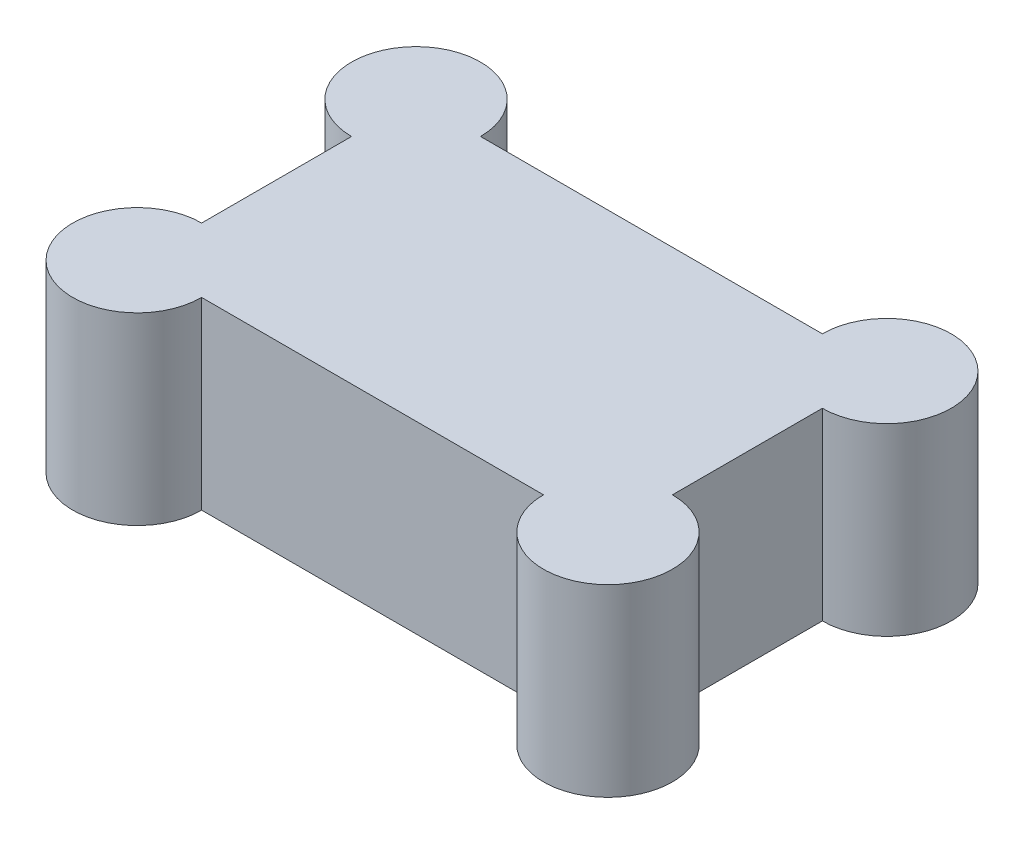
from build123d import *

# Parameters (mm, degrees)
BOSS_EXTRUDE1_DEPTH = 20


with BuildPart() as part:
    # Sketch1 → Boss-Extrude1 (new body)
    with BuildSketch(Plane(origin=(0, 0, 0), x_dir=(1, 0, 0), z_dir=(0, 1, 0))):
        with BuildLine():
            Line((-18.553521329, 15.13629901), (18.553521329, 15.13629901))
            ThreePointArc((18.553521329, 15.13629901), (30.503268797, 20.086046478), (25.553521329, 8.13629901))
            Line((25.553521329, 8.13629901), (25.553521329, -8.13629901))
            ThreePointArc((25.553521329, -8.13629901), (30.503268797, -20.086046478), (18.553521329, -15.13629901))
            Line((18.553521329, -15.13629901), (-18.553521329, -15.13629901))
            ThreePointArc((-18.553521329, -15.13629901), (-30.503268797, -20.086046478), (-25.553521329, -8.13629901))
            Line((-25.553521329, -8.13629901), (-25.553521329, 8.13629901))
            ThreePointArc((-25.553521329, 8.13629901), (-30.503268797, 20.086046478), (-18.553521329, 15.13629901))
        make_face()
    extrude(amount=BOSS_EXTRUDE1_DEPTH)


solid = part.part
